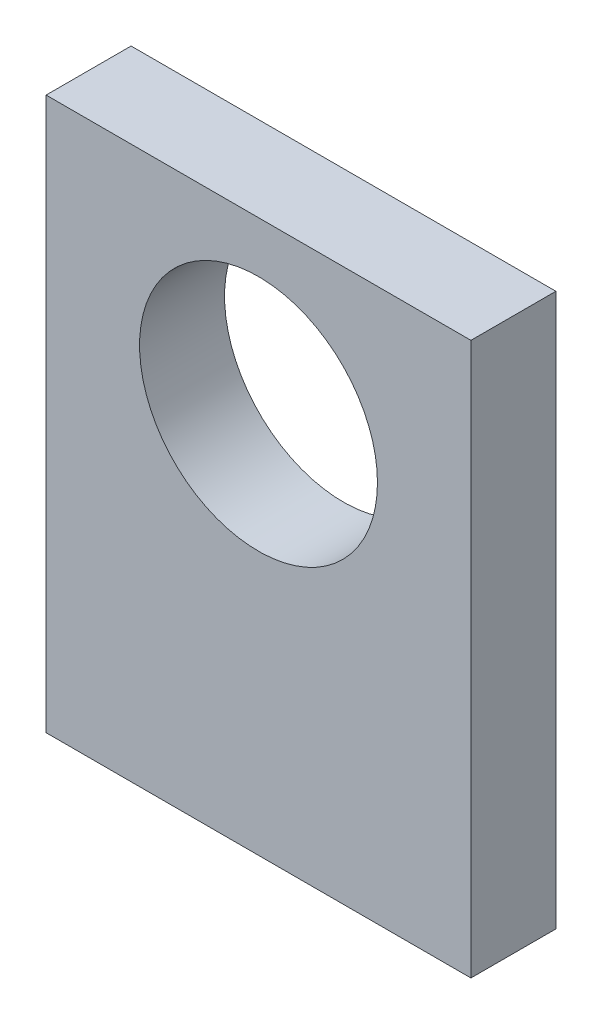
ISO-10303-21;
HEADER;
FILE_DESCRIPTION(('STEP AP214'),'2;1');
FILE_NAME('part.step','',(''),(''),'','','');
FILE_SCHEMA(('AUTOMOTIVE_DESIGN { 1 0 10303 214 1 1 1 1 }'));
ENDSEC;
DATA;
#1=APPLICATION_CONTEXT('core data for automotive mechanical design processes');
#2=APPLICATION_PROTOCOL_DEFINITION('international standard','automotive_design',2000,#1);
#3=PRODUCT_CONTEXT('',#1,'mechanical');
#4=PRODUCT('Part','Part','',(#3));
#5=PRODUCT_RELATED_PRODUCT_CATEGORY('part','',(#4));
#6=PRODUCT_DEFINITION_FORMATION('','',#4);
#7=PRODUCT_DEFINITION_CONTEXT('part definition',#1,'design');
#8=PRODUCT_DEFINITION('design','',#6,#7);
#9=PRODUCT_DEFINITION_SHAPE('','',#8);
#10=(LENGTH_UNIT() NAMED_UNIT(*) SI_UNIT(.MILLI.,.METRE.));
#11=(NAMED_UNIT(*) PLANE_ANGLE_UNIT() SI_UNIT($,.RADIAN.));
#12=(NAMED_UNIT(*) SI_UNIT($,.STERADIAN.) SOLID_ANGLE_UNIT());
#13=UNCERTAINTY_MEASURE_WITH_UNIT(LENGTH_MEASURE(1.E-05),#10,'distance_accuracy_value','');
#14=(GEOMETRIC_REPRESENTATION_CONTEXT(3) GLOBAL_UNCERTAINTY_ASSIGNED_CONTEXT((#13)) GLOBAL_UNIT_ASSIGNED_CONTEXT((#10,
#11,#12)) REPRESENTATION_CONTEXT('',''));
#15=CARTESIAN_POINT('',(0.,0.,0.));
#16=DIRECTION('',(0.,0.,1.));
#17=DIRECTION('',(1.,0.,0.));
#18=AXIS2_PLACEMENT_3D('',#15,#16,#17);
#19=CARTESIAN_POINT('',(-25.,32.5,10.));
#20=DIRECTION('',(1.,0.,0.));
#21=DIRECTION('',(0.,1.,0.));
#22=AXIS2_PLACEMENT_3D('',#19,#20,#21);
#23=PLANE('',#22);
#24=DIRECTION('',(0.,-1.,0.));
#25=VECTOR('',#24,1.);
#26=CARTESIAN_POINT('',(-25.,32.5,0.));
#27=LINE('',#26,#25);
#28=CARTESIAN_POINT('',(-25.,32.5,0.));
#29=VERTEX_POINT('',#28);
#30=CARTESIAN_POINT('',(-25.,-32.5,0.));
#31=VERTEX_POINT('',#30);
#32=EDGE_CURVE('E118',#29,#31,#27,.T.);
#33=ORIENTED_EDGE('',*,*,#32,.T.);
#34=DIRECTION('',(0.,0.,-1.));
#35=VECTOR('',#34,1.);
#36=CARTESIAN_POINT('',(-25.,-32.5,10.));
#37=LINE('',#36,#35);
#38=CARTESIAN_POINT('',(-25.,-32.5,10.));
#39=VERTEX_POINT('',#38);
#40=EDGE_CURVE('E11',#39,#31,#37,.T.);
#41=ORIENTED_EDGE('',*,*,#40,.F.);
#42=DIRECTION('',(0.,-1.,0.));
#43=VECTOR('',#42,1.);
#44=CARTESIAN_POINT('',(-25.,32.5,10.));
#45=LINE('',#44,#43);
#46=CARTESIAN_POINT('',(-25.,32.5,10.));
#47=VERTEX_POINT('',#46);
#48=EDGE_CURVE('E119',#47,#39,#45,.T.);
#49=ORIENTED_EDGE('',*,*,#48,.F.);
#50=DIRECTION('',(0.,0.,-1.));
#51=VECTOR('',#50,1.);
#52=CARTESIAN_POINT('',(-25.,32.5,10.));
#53=LINE('',#52,#51);
#54=EDGE_CURVE('E125',#47,#29,#53,.T.);
#55=ORIENTED_EDGE('',*,*,#54,.T.);
#56=EDGE_LOOP('',(#33,#41,#49,#55));
#57=FACE_BOUND('',#56,.T.);
#58=ADVANCED_FACE('F37',(#57),#23,.F.);
#59=CARTESIAN_POINT('',(25.,-32.5,10.));
#60=DIRECTION('',(0.,1.,0.));
#61=DIRECTION('',(-1.,0.,0.));
#62=AXIS2_PLACEMENT_3D('',#59,#60,#61);
#63=PLANE('',#62);
#64=CARTESIAN_POINT('',(-20.75,-32.5,5.));
#65=DIRECTION('',(0.,-1.,0.));
#66=DIRECTION('',(0.,0.,-1.));
#67=AXIS2_PLACEMENT_3D('',#64,#65,#66);
#68=CIRCLE('',#67,2.1);
#69=CARTESIAN_POINT('',(-20.75,-32.5,2.9));
#70=VERTEX_POINT('',#69);
#71=EDGE_CURVE('E102',#70,#70,#68,.T.);
#72=ORIENTED_EDGE('',*,*,#71,.F.);
#73=EDGE_LOOP('',(#72));
#74=FACE_BOUND('',#73,.T.);
#75=CARTESIAN_POINT('',(20.75,-32.5,5.00000000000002));
#76=DIRECTION('',(0.,-1.,0.));
#77=DIRECTION('',(0.,0.,-1.));
#78=AXIS2_PLACEMENT_3D('',#75,#76,#77);
#79=CIRCLE('',#78,2.1);
#80=CARTESIAN_POINT('',(20.75,-32.5,2.90000000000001));
#81=VERTEX_POINT('',#80);
#82=EDGE_CURVE('E101',#81,#81,#79,.T.);
#83=ORIENTED_EDGE('',*,*,#82,.F.);
#84=EDGE_LOOP('',(#83));
#85=FACE_BOUND('',#84,.T.);
#86=DIRECTION('',(1.,0.,0.));
#87=VECTOR('',#86,1.);
#88=CARTESIAN_POINT('',(25.,-32.5,0.));
#89=LINE('',#88,#87);
#90=CARTESIAN_POINT('',(25.,-32.5,0.));
#91=VERTEX_POINT('',#90);
#92=EDGE_CURVE('E128',#31,#91,#89,.T.);
#93=ORIENTED_EDGE('',*,*,#92,.T.);
#94=DIRECTION('',(0.,0.,-1.));
#95=VECTOR('',#94,1.);
#96=CARTESIAN_POINT('',(25.,-32.5,10.));
#97=LINE('',#96,#95);
#98=CARTESIAN_POINT('',(25.,-32.5,10.));
#99=VERTEX_POINT('',#98);
#100=EDGE_CURVE('E45',#99,#91,#97,.T.);
#101=ORIENTED_EDGE('',*,*,#100,.F.);
#102=DIRECTION('',(1.,0.,0.));
#103=VECTOR('',#102,1.);
#104=CARTESIAN_POINT('',(25.,-32.5,10.));
#105=LINE('',#104,#103);
#106=EDGE_CURVE('E84',#39,#99,#105,.T.);
#107=ORIENTED_EDGE('',*,*,#106,.F.);
#108=ORIENTED_EDGE('',*,*,#40,.T.);
#109=EDGE_LOOP('',(#93,#101,#107,#108));
#110=FACE_BOUND('',#109,.T.);
#111=ADVANCED_FACE('F152',(#74,#85,#110),#63,.F.);
#112=CARTESIAN_POINT('',(25.,32.5,10.));
#113=DIRECTION('',(-1.,0.,0.));
#114=DIRECTION('',(0.,-1.,0.));
#115=AXIS2_PLACEMENT_3D('',#112,#113,#114);
#116=PLANE('',#115);
#117=DIRECTION('',(0.,1.,0.));
#118=VECTOR('',#117,1.);
#119=CARTESIAN_POINT('',(25.,32.5,0.));
#120=LINE('',#119,#118);
#121=CARTESIAN_POINT('',(25.,32.5,0.));
#122=VERTEX_POINT('',#121);
#123=EDGE_CURVE('E71',#91,#122,#120,.T.);
#124=ORIENTED_EDGE('',*,*,#123,.T.);
#125=DIRECTION('',(0.,0.,-1.));
#126=VECTOR('',#125,1.);
#127=CARTESIAN_POINT('',(25.,32.5,10.));
#128=LINE('',#127,#126);
#129=CARTESIAN_POINT('',(25.,32.5,10.));
#130=VERTEX_POINT('',#129);
#131=EDGE_CURVE('E133',#130,#122,#128,.T.);
#132=ORIENTED_EDGE('',*,*,#131,.F.);
#133=DIRECTION('',(0.,1.,0.));
#134=VECTOR('',#133,1.);
#135=CARTESIAN_POINT('',(25.,32.5,10.));
#136=LINE('',#135,#134);
#137=EDGE_CURVE('E122',#99,#130,#136,.T.);
#138=ORIENTED_EDGE('',*,*,#137,.F.);
#139=ORIENTED_EDGE('',*,*,#100,.T.);
#140=EDGE_LOOP('',(#124,#132,#138,#139));
#141=FACE_BOUND('',#140,.T.);
#142=ADVANCED_FACE('F135',(#141),#116,.F.);
#143=CARTESIAN_POINT('',(25.,32.5,10.));
#144=DIRECTION('',(0.,-1.,0.));
#145=DIRECTION('',(1.,0.,0.));
#146=AXIS2_PLACEMENT_3D('',#143,#144,#145);
#147=PLANE('',#146);
#148=DIRECTION('',(-1.,0.,0.));
#149=VECTOR('',#148,1.);
#150=CARTESIAN_POINT('',(25.,32.5,0.));
#151=LINE('',#150,#149);
#152=EDGE_CURVE('E77',#122,#29,#151,.T.);
#153=ORIENTED_EDGE('',*,*,#152,.T.);
#154=ORIENTED_EDGE('',*,*,#54,.F.);
#155=DIRECTION('',(-1.,0.,0.));
#156=VECTOR('',#155,1.);
#157=CARTESIAN_POINT('',(25.,32.5,10.));
#158=LINE('',#157,#156);
#159=EDGE_CURVE('E53',#130,#47,#158,.T.);
#160=ORIENTED_EDGE('',*,*,#159,.F.);
#161=ORIENTED_EDGE('',*,*,#131,.T.);
#162=EDGE_LOOP('',(#153,#154,#160,#161));
#163=FACE_BOUND('',#162,.T.);
#164=ADVANCED_FACE('F142',(#163),#147,.F.);
#165=CARTESIAN_POINT('',(0.,0.,10.));
#166=DIRECTION('',(0.,0.,-1.));
#167=DIRECTION('',(-1.,0.,0.));
#168=AXIS2_PLACEMENT_3D('',#165,#166,#167);
#169=PLANE('',#168);
#170=CARTESIAN_POINT('',(0.,12.5,10.));
#171=DIRECTION('',(0.,0.,1.));
#172=DIRECTION('',(1.,0.,0.));
#173=AXIS2_PLACEMENT_3D('',#170,#171,#172);
#174=CIRCLE('',#173,14.);
#175=CARTESIAN_POINT('',(14.,12.5,10.));
#176=VERTEX_POINT('',#175);
#177=EDGE_CURVE('E112',#176,#176,#174,.T.);
#178=ORIENTED_EDGE('',*,*,#177,.F.);
#179=EDGE_LOOP('',(#178));
#180=FACE_BOUND('',#179,.T.);
#181=ORIENTED_EDGE('',*,*,#48,.T.);
#182=ORIENTED_EDGE('',*,*,#106,.T.);
#183=ORIENTED_EDGE('',*,*,#137,.T.);
#184=ORIENTED_EDGE('',*,*,#159,.T.);
#185=EDGE_LOOP('',(#181,#182,#183,#184));
#186=FACE_BOUND('',#185,.T.);
#187=ADVANCED_FACE('F144',(#180,#186),#169,.F.);
#188=CARTESIAN_POINT('',(0.,0.,0.));
#189=DIRECTION('',(0.,0.,-1.));
#190=DIRECTION('',(-1.,0.,0.));
#191=AXIS2_PLACEMENT_3D('',#188,#189,#190);
#192=PLANE('',#191);
#193=CARTESIAN_POINT('',(0.,12.5,0.));
#194=DIRECTION('',(0.,0.,1.));
#195=DIRECTION('',(1.,0.,0.));
#196=AXIS2_PLACEMENT_3D('',#193,#194,#195);
#197=CIRCLE('',#196,14.);
#198=CARTESIAN_POINT('',(14.,12.5,0.));
#199=VERTEX_POINT('',#198);
#200=EDGE_CURVE('E115',#199,#199,#197,.T.);
#201=ORIENTED_EDGE('',*,*,#200,.T.);
#202=EDGE_LOOP('',(#201));
#203=FACE_BOUND('',#202,.T.);
#204=ORIENTED_EDGE('',*,*,#32,.F.);
#205=ORIENTED_EDGE('',*,*,#152,.F.);
#206=ORIENTED_EDGE('',*,*,#123,.F.);
#207=ORIENTED_EDGE('',*,*,#92,.F.);
#208=EDGE_LOOP('',(#204,#205,#206,#207));
#209=FACE_BOUND('',#208,.T.);
#210=ADVANCED_FACE('F138',(#203,#209),#192,.T.);
#211=CARTESIAN_POINT('',(0.,12.5,10.));
#212=DIRECTION('',(0.,0.,1.));
#213=DIRECTION('',(1.,0.,0.));
#214=AXIS2_PLACEMENT_3D('',#211,#212,#213);
#215=CYLINDRICAL_SURFACE('',#214,14.);
#216=ORIENTED_EDGE('',*,*,#200,.F.);
#217=EDGE_LOOP('',(#216));
#218=FACE_BOUND('',#217,.T.);
#219=ORIENTED_EDGE('',*,*,#177,.T.);
#220=EDGE_LOOP('',(#219));
#221=FACE_BOUND('',#220,.T.);
#222=ADVANCED_FACE('F173',(#218,#221),#215,.F.);
#223=CARTESIAN_POINT('',(20.75,-18.5,5.00000000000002));
#224=DIRECTION('',(0.,-1.,0.));
#225=DIRECTION('',(0.,0.,-1.));
#226=AXIS2_PLACEMENT_3D('',#223,#224,#225);
#227=CONICAL_SURFACE('',#226,2.1,1.02974425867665);
#228=CARTESIAN_POINT('',(20.75,-17.2381927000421,5.00000000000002));
#229=VERTEX_POINT('',#228);
#230=VERTEX_LOOP('',#229);
#231=FACE_BOUND('',#230,.T.);
#232=CARTESIAN_POINT('',(20.75,-18.5,5.00000000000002));
#233=DIRECTION('',(0.,-1.,0.));
#234=DIRECTION('',(0.,0.,-1.));
#235=AXIS2_PLACEMENT_3D('',#232,#233,#234);
#236=CIRCLE('',#235,2.1);
#237=CARTESIAN_POINT('',(20.75,-18.5,2.90000000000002));
#238=VERTEX_POINT('',#237);
#239=EDGE_CURVE('E105',#238,#238,#236,.T.);
#240=ORIENTED_EDGE('',*,*,#239,.T.);
#241=EDGE_LOOP('',(#240));
#242=FACE_BOUND('',#241,.T.);
#243=ADVANCED_FACE('F167',(#231,#242),#227,.F.);
#244=CARTESIAN_POINT('',(20.75,-32.5,5.00000000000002));
#245=DIRECTION('',(0.,-1.,0.));
#246=DIRECTION('',(0.,0.,-1.));
#247=AXIS2_PLACEMENT_3D('',#244,#245,#246);
#248=CYLINDRICAL_SURFACE('',#247,2.1);
#249=ORIENTED_EDGE('',*,*,#239,.F.);
#250=EDGE_LOOP('',(#249));
#251=FACE_BOUND('',#250,.T.);
#252=ORIENTED_EDGE('',*,*,#82,.T.);
#253=EDGE_LOOP('',(#252));
#254=FACE_BOUND('',#253,.T.);
#255=ADVANCED_FACE('F95',(#251,#254),#248,.F.);
#256=CARTESIAN_POINT('',(-20.75,-18.5,5.));
#257=DIRECTION('',(0.,-1.,0.));
#258=DIRECTION('',(0.,0.,-1.));
#259=AXIS2_PLACEMENT_3D('',#256,#257,#258);
#260=CONICAL_SURFACE('',#259,2.1,1.02974425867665);
#261=CARTESIAN_POINT('',(-20.75,-17.2381927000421,5.));
#262=VERTEX_POINT('',#261);
#263=VERTEX_LOOP('',#262);
#264=FACE_BOUND('',#263,.T.);
#265=CARTESIAN_POINT('',(-20.75,-18.5,5.));
#266=DIRECTION('',(0.,-1.,0.));
#267=DIRECTION('',(0.,0.,-1.));
#268=AXIS2_PLACEMENT_3D('',#265,#266,#267);
#269=CIRCLE('',#268,2.1);
#270=CARTESIAN_POINT('',(-20.75,-18.5,2.9));
#271=VERTEX_POINT('',#270);
#272=EDGE_CURVE('E99',#271,#271,#269,.T.);
#273=ORIENTED_EDGE('',*,*,#272,.T.);
#274=EDGE_LOOP('',(#273));
#275=FACE_BOUND('',#274,.T.);
#276=ADVANCED_FACE('F91',(#264,#275),#260,.F.);
#277=CARTESIAN_POINT('',(-20.75,-32.5,5.));
#278=DIRECTION('',(0.,-1.,0.));
#279=DIRECTION('',(0.,0.,-1.));
#280=AXIS2_PLACEMENT_3D('',#277,#278,#279);
#281=CYLINDRICAL_SURFACE('',#280,2.1);
#282=ORIENTED_EDGE('',*,*,#272,.F.);
#283=EDGE_LOOP('',(#282));
#284=FACE_BOUND('',#283,.T.);
#285=ORIENTED_EDGE('',*,*,#71,.T.);
#286=EDGE_LOOP('',(#285));
#287=FACE_BOUND('',#286,.T.);
#288=ADVANCED_FACE('F94',(#284,#287),#281,.F.);
#289=CLOSED_SHELL('',(#58,#111,#142,#164,#187,#210,#222,#243,#255,#276,#288));
#290=MANIFOLD_SOLID_BREP('B2',#289);
#291=ADVANCED_BREP_SHAPE_REPRESENTATION('',(#18,#290),#14);
#292=SHAPE_DEFINITION_REPRESENTATION(#9,#291);
ENDSEC;
END-ISO-10303-21;
